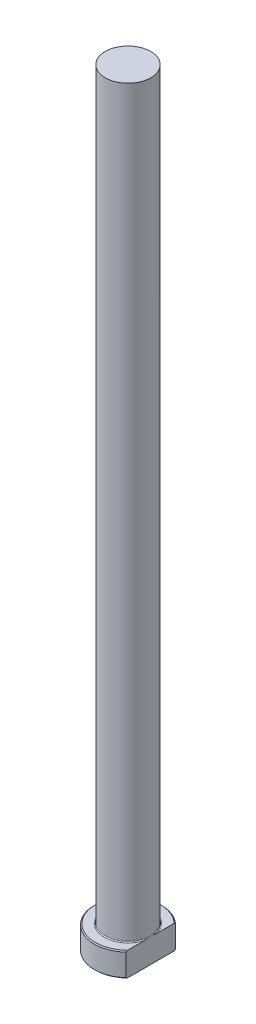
ISO-10303-21;
HEADER;
FILE_DESCRIPTION(('STEP AP214'),'2;1');
FILE_NAME('part.step','',(''),(''),'','','');
FILE_SCHEMA(('AUTOMOTIVE_DESIGN { 1 0 10303 214 1 1 1 1 }'));
ENDSEC;
DATA;
#1=APPLICATION_CONTEXT('core data for automotive mechanical design processes');
#2=APPLICATION_PROTOCOL_DEFINITION('international standard','automotive_design',2000,#1);
#3=PRODUCT_CONTEXT('',#1,'mechanical');
#4=PRODUCT('Part','Part','',(#3));
#5=PRODUCT_RELATED_PRODUCT_CATEGORY('part','',(#4));
#6=PRODUCT_DEFINITION_FORMATION('','',#4);
#7=PRODUCT_DEFINITION_CONTEXT('part definition',#1,'design');
#8=PRODUCT_DEFINITION('design','',#6,#7);
#9=PRODUCT_DEFINITION_SHAPE('','',#8);
#10=(LENGTH_UNIT() NAMED_UNIT(*) SI_UNIT(.MILLI.,.METRE.));
#11=(NAMED_UNIT(*) PLANE_ANGLE_UNIT() SI_UNIT($,.RADIAN.));
#12=(NAMED_UNIT(*) SI_UNIT($,.STERADIAN.) SOLID_ANGLE_UNIT());
#13=UNCERTAINTY_MEASURE_WITH_UNIT(LENGTH_MEASURE(1.E-05),#10,'distance_accuracy_value','');
#14=(GEOMETRIC_REPRESENTATION_CONTEXT(3) GLOBAL_UNCERTAINTY_ASSIGNED_CONTEXT((#13)) GLOBAL_UNIT_ASSIGNED_CONTEXT((#10,
#11,#12)) REPRESENTATION_CONTEXT('',''));
#15=CARTESIAN_POINT('',(0.,0.,0.));
#16=DIRECTION('',(0.,0.,1.));
#17=DIRECTION('',(1.,0.,0.));
#18=AXIS2_PLACEMENT_3D('',#15,#16,#17);
#19=CARTESIAN_POINT('',(0.,0.,0.));
#20=DIRECTION('',(0.,-1.,0.));
#21=DIRECTION('',(0.,0.,-1.));
#22=AXIS2_PLACEMENT_3D('',#19,#20,#21);
#23=PLANE('',#22);
#24=CARTESIAN_POINT('',(0.,0.,0.));
#25=DIRECTION('',(0.,-1.,0.));
#26=DIRECTION('',(0.,0.,-1.));
#27=AXIS2_PLACEMENT_3D('',#24,#25,#26);
#28=CIRCLE('',#27,6.79999999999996);
#29=CARTESIAN_POINT('',(4.74999999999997,0.,4.86595314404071));
#30=VERTEX_POINT('',#29);
#31=CARTESIAN_POINT('',(4.74999999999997,0.,-4.86595314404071));
#32=VERTEX_POINT('',#31);
#33=EDGE_CURVE('E98',#30,#32,#28,.T.);
#34=ORIENTED_EDGE('',*,*,#33,.T.);
#35=DIRECTION('',(0.,0.,1.));
#36=VECTOR('',#35,1.);
#37=CARTESIAN_POINT('',(4.74999999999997,0.,-5.14174095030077));
#38=LINE('',#37,#36);
#39=EDGE_CURVE('E83',#32,#30,#38,.T.);
#40=ORIENTED_EDGE('',*,*,#39,.T.);
#41=EDGE_LOOP('',(#34,#40));
#42=FACE_BOUND('',#41,.T.);
#43=ADVANCED_FACE('F32',(#42),#23,.T.);
#44=CARTESIAN_POINT('',(0.,259.958771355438,0.));
#45=DIRECTION('',(0.,1.,0.));
#46=DIRECTION('',(0.,0.,1.));
#47=AXIS2_PLACEMENT_3D('',#44,#45,#46);
#48=CYLINDRICAL_SURFACE('',#47,6.99999999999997);
#49=CARTESIAN_POINT('',(0.,4.80000000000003,0.));
#50=DIRECTION('',(0.,1.,0.));
#51=DIRECTION('',(0.,0.,1.));
#52=AXIS2_PLACEMENT_3D('',#49,#50,#51);
#53=CIRCLE('',#52,6.99999999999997);
#54=CARTESIAN_POINT('',(4.74999999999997,4.80000000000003,5.14174095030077));
#55=VERTEX_POINT('',#54);
#56=CARTESIAN_POINT('',(4.74999999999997,4.80000000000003,-5.14174095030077));
#57=VERTEX_POINT('',#56);
#58=EDGE_CURVE('E104',#55,#57,#53,.F.);
#59=ORIENTED_EDGE('',*,*,#58,.T.);
#60=DIRECTION('',(0.,-1.,0.));
#61=VECTOR('',#60,1.);
#62=CARTESIAN_POINT('',(4.74999999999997,160.,-5.14174095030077));
#63=LINE('',#62,#61);
#64=CARTESIAN_POINT('',(4.74999999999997,0.200000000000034,-5.14174095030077));
#65=VERTEX_POINT('',#64);
#66=EDGE_CURVE('E183',#57,#65,#63,.T.);
#67=ORIENTED_EDGE('',*,*,#66,.T.);
#68=CARTESIAN_POINT('',(0.,0.200000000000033,0.));
#69=DIRECTION('',(0.,-1.,0.));
#70=DIRECTION('',(0.,0.,-1.));
#71=AXIS2_PLACEMENT_3D('',#68,#69,#70);
#72=CIRCLE('',#71,6.99999999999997);
#73=CARTESIAN_POINT('',(4.74999999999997,0.200000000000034,5.14174095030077));
#74=VERTEX_POINT('',#73);
#75=EDGE_CURVE('E100',#65,#74,#72,.F.);
#76=ORIENTED_EDGE('',*,*,#75,.T.);
#77=DIRECTION('',(0.,-1.,0.));
#78=VECTOR('',#77,1.);
#79=CARTESIAN_POINT('',(4.74999999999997,160.,5.14174095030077));
#80=LINE('',#79,#78);
#81=EDGE_CURVE('E93',#55,#74,#80,.T.);
#82=ORIENTED_EDGE('',*,*,#81,.F.);
#83=EDGE_LOOP('',(#59,#67,#76,#82));
#84=FACE_BOUND('',#83,.T.);
#85=ADVANCED_FACE('F158',(#84),#48,.T.);
#86=CARTESIAN_POINT('',(-6.99999999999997,5.,0.));
#87=DIRECTION('',(0.,1.,0.));
#88=DIRECTION('',(0.,0.,1.));
#89=AXIS2_PLACEMENT_3D('',#86,#87,#88);
#90=PLANE('',#89);
#91=CARTESIAN_POINT('',(0.,5.,0.));
#92=DIRECTION('',(0.,1.,0.));
#93=DIRECTION('',(0.,0.,1.));
#94=AXIS2_PLACEMENT_3D('',#91,#92,#93);
#95=CIRCLE('',#94,6.80000000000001);
#96=CARTESIAN_POINT('',(4.74999999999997,5.,-4.86595314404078));
#97=VERTEX_POINT('',#96);
#98=CARTESIAN_POINT('',(4.74999999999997,5.,4.86595314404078));
#99=VERTEX_POINT('',#98);
#100=EDGE_CURVE('E178',#97,#99,#95,.T.);
#101=ORIENTED_EDGE('',*,*,#100,.T.);
#102=DIRECTION('',(0.,0.,-1.));
#103=VECTOR('',#102,1.);
#104=CARTESIAN_POINT('',(4.74999999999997,5.,0.));
#105=LINE('',#104,#103);
#106=CARTESIAN_POINT('',(4.74999999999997,4.99999999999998,1.3928388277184));
#107=VERTEX_POINT('',#106);
#108=EDGE_CURVE('E57',#99,#107,#105,.T.);
#109=ORIENTED_EDGE('',*,*,#108,.T.);
#110=CARTESIAN_POINT('',(0.,5.,0.));
#111=DIRECTION('',(0.,1.,0.));
#112=DIRECTION('',(0.,0.,1.));
#113=AXIS2_PLACEMENT_3D('',#110,#111,#112);
#114=CIRCLE('',#113,4.94999999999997);
#115=CARTESIAN_POINT('',(4.74999999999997,4.99999999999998,-1.3928388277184));
#116=VERTEX_POINT('',#115);
#117=EDGE_CURVE('E107',#107,#116,#114,.F.);
#118=ORIENTED_EDGE('',*,*,#117,.T.);
#119=EDGE_CURVE('E136',#116,#97,#105,.T.);
#120=ORIENTED_EDGE('',*,*,#119,.T.);
#121=EDGE_LOOP('',(#101,#109,#118,#120));
#122=FACE_BOUND('',#121,.T.);
#123=ADVANCED_FACE('F147',(#122),#90,.T.);
#124=CARTESIAN_POINT('',(0.,5.,0.));
#125=DIRECTION('',(0.,-1.,0.));
#126=DIRECTION('',(0.,0.,-1.));
#127=AXIS2_PLACEMENT_3D('',#124,#125,#126);
#128=CONICAL_SURFACE('',#127,6.8,0.785398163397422);
#129=ORIENTED_EDGE('',*,*,#58,.F.);
#130=CARTESIAN_POINT('',(4.74999999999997,-0.469919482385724,11.3131969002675));
#131=CARTESIAN_POINT('',(4.74999999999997,-0.314696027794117,11.1448436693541));
#132=CARTESIAN_POINT('',(4.74999999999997,-0.159749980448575,10.9762347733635));
#133=CARTESIAN_POINT('',(4.74999999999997,0.14950352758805,10.6384300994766));
#134=CARTESIAN_POINT('',(4.74999999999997,0.30381098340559,10.4692343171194));
#135=CARTESIAN_POINT('',(4.74999999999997,0.765713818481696,9.96058276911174));
#136=CARTESIAN_POINT('',(4.74999999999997,1.07222147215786,9.62013661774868));
#137=CARTESIAN_POINT('',(4.74999999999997,1.68320129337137,8.93374171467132));
#138=CARTESIAN_POINT('',(4.74999999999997,1.98765016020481,8.58777219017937));
#139=CARTESIAN_POINT('',(4.74999999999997,2.59113928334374,7.89119777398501));
#140=CARTESIAN_POINT('',(4.74999999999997,2.8901801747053,7.54059343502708));
#141=CARTESIAN_POINT('',(4.74999999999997,3.42455557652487,6.90003552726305));
#142=CARTESIAN_POINT('',(4.74999999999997,3.6612159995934,6.61119029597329));
#143=CARTESIAN_POINT('',(4.74999999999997,4.12759376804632,6.02778658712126));
#144=CARTESIAN_POINT('',(4.74999999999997,4.35730941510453,5.73322674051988));
#145=CARTESIAN_POINT('',(4.74999999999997,4.69416955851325,5.28581629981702));
#146=CARTESIAN_POINT('',(4.74999999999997,4.80511599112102,5.13582910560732));
#147=CARTESIAN_POINT('',(4.74999999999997,5.02390767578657,4.83361366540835));
#148=CARTESIAN_POINT('',(4.74999999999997,5.13175307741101,4.68138552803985));
#149=CARTESIAN_POINT('',(4.74999999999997,5.34359776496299,4.37435384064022));
#150=CARTESIAN_POINT('',(4.74999999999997,5.44759851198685,4.21955130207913));
#151=CARTESIAN_POINT('',(4.74999999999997,5.65085213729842,3.9068707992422));
#152=CARTESIAN_POINT('',(4.74999999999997,5.75010555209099,3.74899318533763));
#153=CARTESIAN_POINT('',(4.74999999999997,5.94167933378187,3.43122886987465));
#154=CARTESIAN_POINT('',(4.74999999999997,6.03405942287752,3.27137837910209));
#155=CARTESIAN_POINT('',(4.74999999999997,6.21141459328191,2.94756528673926));
#156=CARTESIAN_POINT('',(4.74999999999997,6.29638886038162,2.78360223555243));
#157=CARTESIAN_POINT('',(4.74999999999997,6.45680192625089,2.45121104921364));
#158=CARTESIAN_POINT('',(4.74999999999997,6.53224904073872,2.28278696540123));
#159=CARTESIAN_POINT('',(4.74999999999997,6.67109238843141,1.94101575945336));
#160=CARTESIAN_POINT('',(4.74999999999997,6.73449211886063,1.76767008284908));
#161=CARTESIAN_POINT('',(4.74999999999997,6.83411180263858,1.45416369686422));
#162=CARTESIAN_POINT('',(4.74999999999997,6.87324454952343,1.31493382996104));
#163=CARTESIAN_POINT('',(4.74999999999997,6.94070239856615,1.03386040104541));
#164=CARTESIAN_POINT('',(4.74999999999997,6.96902891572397,0.892017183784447));
#165=CARTESIAN_POINT('',(4.74999999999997,7.01345691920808,0.606842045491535));
#166=CARTESIAN_POINT('',(4.74999999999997,7.02959521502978,0.463515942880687));
#167=CARTESIAN_POINT('',(4.74999999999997,7.04890487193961,0.17598432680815));
#168=CARTESIAN_POINT('',(4.74999999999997,7.05207679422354,0.0317788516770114));
#169=CARTESIAN_POINT('',(4.74999999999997,7.04526462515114,-0.256545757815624));
#170=CARTESIAN_POINT('',(4.74999999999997,7.03525957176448,-0.400664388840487));
#171=CARTESIAN_POINT('',(4.74999999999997,7.00262759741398,-0.687454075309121));
#172=CARTESIAN_POINT('',(4.74999999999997,6.97999962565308,-0.830125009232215));
#173=CARTESIAN_POINT('',(4.74999999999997,6.92319898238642,-1.11357185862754));
#174=CARTESIAN_POINT('',(4.74999999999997,6.88899117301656,-1.25434063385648));
#175=CARTESIAN_POINT('',(4.74999999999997,6.8105357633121,-1.53301777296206));
#176=CARTESIAN_POINT('',(4.74999999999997,6.76628793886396,-1.67092607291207));
#177=CARTESIAN_POINT('',(4.74999999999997,6.6615135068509,-1.96556191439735));
#178=CARTESIAN_POINT('',(4.74999999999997,6.59951436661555,-2.12176199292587));
#179=CARTESIAN_POINT('',(4.74999999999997,6.46624368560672,-2.43018851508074));
#180=CARTESIAN_POINT('',(4.74999999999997,6.39496797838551,-2.58241313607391));
#181=CARTESIAN_POINT('',(4.74999999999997,6.24487152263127,-2.88340045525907));
#182=CARTESIAN_POINT('',(4.74999999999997,6.16603778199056,-3.0321566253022));
#183=CARTESIAN_POINT('',(4.74999999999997,6.00242135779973,-3.3263122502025));
#184=CARTESIAN_POINT('',(4.74999999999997,5.91763949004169,-3.4717121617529));
#185=CARTESIAN_POINT('',(4.74999999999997,5.74221965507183,-3.76133460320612));
#186=CARTESIAN_POINT('',(4.74999999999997,5.65152319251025,-3.90552153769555));
#187=CARTESIAN_POINT('',(4.74999999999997,5.46614513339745,-4.19130524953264));
#188=CARTESIAN_POINT('',(4.74999999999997,5.37146343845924,-4.33290196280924));
#189=CARTESIAN_POINT('',(4.74999999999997,5.1789439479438,-4.6137100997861));
#190=CARTESIAN_POINT('',(4.74999999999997,5.0811095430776,-4.75292385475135));
#191=CARTESIAN_POINT('',(4.74999999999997,4.88274984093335,-5.02942406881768));
#192=CARTESIAN_POINT('',(4.74999999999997,4.78222443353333,-5.16671044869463));
#193=CARTESIAN_POINT('',(4.74999999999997,4.47850577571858,-5.57446661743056));
#194=CARTESIAN_POINT('',(4.74999999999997,4.27202152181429,-5.84248508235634));
#195=CARTESIAN_POINT('',(4.74999999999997,3.85277361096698,-6.37356852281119));
#196=CARTESIAN_POINT('',(4.74999999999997,3.64000936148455,-6.63663302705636));
#197=CARTESIAN_POINT('',(4.74999999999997,3.20967704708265,-7.15912738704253));
#198=CARTESIAN_POINT('',(4.74999999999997,2.99210547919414,-7.41855435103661));
#199=CARTESIAN_POINT('',(4.74999999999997,2.55343543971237,-7.93440929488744));
#200=CARTESIAN_POINT('',(4.74999999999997,2.33233690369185,-8.190837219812));
#201=CARTESIAN_POINT('',(4.74999999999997,1.89851178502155,-8.68856037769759));
#202=CARTESIAN_POINT('',(4.74999999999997,1.68591840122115,-8.92997190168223));
#203=CARTESIAN_POINT('',(4.74999999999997,1.25875024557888,-9.41103988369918));
#204=CARTESIAN_POINT('',(4.74999999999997,1.04417544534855,-9.65069631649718));
#205=CARTESIAN_POINT('',(4.74999999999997,0.61376154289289,-10.128184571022));
#206=CARTESIAN_POINT('',(4.74999999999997,0.397924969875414,-10.3660186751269));
#207=CARTESIAN_POINT('',(4.74999999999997,-0.0350706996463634,-10.8404648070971));
#208=CARTESIAN_POINT('',(4.74999999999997,-0.252229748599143,-11.0770768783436));
#209=CARTESIAN_POINT('',(4.74999999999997,-0.469919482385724,-11.3131969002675));
#210=B_SPLINE_CURVE_WITH_KNOTS('',3,(#130,#131,#132,#133,#134,#135,#136,#137,#138,#139,#140,
#141,#142,#143,#144,#145,#146,#147,#148,#149,#150,#151,#152,#153,#154,#155,#156,#157,#158,#159,
#160,#161,#162,#163,#164,#165,#166,#167,#168,#169,#170,#171,#172,#173,#174,#175,#176,#177,#178,
#179,#180,#181,#182,#183,#184,#185,#186,#187,#188,#189,#190,#191,#192,#193,#194,#195,#196,#197,
#198,#199,#200,#201,#202,#203,#204,#205,#206,#207,#208,#209),.UNSPECIFIED.,.F.,.F.,(4,2,2,2,2,2,
2,2,2,2,2,2,2,2,2,2,2,2,2,2,2,2,2,2,2,2,2,2,2,2,2,2,2,2,2,2,2,2,2,4),(0.,0.686973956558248,
1.37395314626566,2.74821299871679,4.13073127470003,5.51308613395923,6.63326732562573,
7.7537202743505,8.31337506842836,8.87300282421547,9.43241566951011,9.99176514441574,
10.5454852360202,11.0992661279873,11.6525602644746,12.2056935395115,12.6392019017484,
13.0726534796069,13.5047907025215,13.9369092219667,14.3697159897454,14.8025587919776,
15.2367269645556,15.6709048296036,16.1746896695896,16.6787015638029,17.1835959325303,
17.6884211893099,18.1993613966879,18.7103142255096,19.2207347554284,19.7311762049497,
20.7460271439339,21.7609741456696,22.7766868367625,23.7924181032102,24.7574331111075,
25.7224619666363,26.6859680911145,27.6494397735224),.UNSPECIFIED.);
#211=EDGE_CURVE('E135',#55,#99,#210,.T.);
#212=ORIENTED_EDGE('',*,*,#211,.T.);
#213=ORIENTED_EDGE('',*,*,#100,.F.);
#214=EDGE_CURVE('E127',#97,#57,#210,.T.);
#215=ORIENTED_EDGE('',*,*,#214,.T.);
#216=EDGE_LOOP('',(#129,#212,#213,#215));
#217=FACE_BOUND('',#216,.T.);
#218=ADVANCED_FACE('F143',(#217),#128,.T.);
#219=CARTESIAN_POINT('',(0.,0.200000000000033,0.));
#220=DIRECTION('',(0.,1.,0.));
#221=DIRECTION('',(0.,0.,1.));
#222=AXIS2_PLACEMENT_3D('',#219,#220,#221);
#223=CONICAL_SURFACE('',#222,6.99999999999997,0.785398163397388);
#224=ORIENTED_EDGE('',*,*,#75,.F.);
#225=CARTESIAN_POINT('',(4.74999999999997,5.46991948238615,-11.3131969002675));
#226=CARTESIAN_POINT('',(4.74999999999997,5.31469602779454,-11.1448436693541));
#227=CARTESIAN_POINT('',(4.74999999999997,5.15974998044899,-10.9762347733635));
#228=CARTESIAN_POINT('',(4.74999999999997,4.85049647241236,-10.6384300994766));
#229=CARTESIAN_POINT('',(4.74999999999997,4.69618901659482,-10.4692343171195));
#230=CARTESIAN_POINT('',(4.74999999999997,4.2342861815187,-9.9605827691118));
#231=CARTESIAN_POINT('',(4.74999999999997,3.92777852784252,-9.62013661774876));
#232=CARTESIAN_POINT('',(4.74999999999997,3.316798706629,-8.93374171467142));
#233=CARTESIAN_POINT('',(4.74999999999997,3.01234983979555,-8.58777219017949));
#234=CARTESIAN_POINT('',(4.74999999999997,2.4088607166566,-7.89119777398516));
#235=CARTESIAN_POINT('',(4.74999999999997,2.10981982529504,-7.54059343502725));
#236=CARTESIAN_POINT('',(4.74999999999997,1.57544442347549,-6.90003552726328));
#237=CARTESIAN_POINT('',(4.74999999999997,1.33878400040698,-6.61119029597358));
#238=CARTESIAN_POINT('',(4.74999999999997,0.8724062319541,-6.02778658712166));
#239=CARTESIAN_POINT('',(4.74999999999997,0.642690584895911,-5.73322674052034));
#240=CARTESIAN_POINT('',(4.74999999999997,0.305830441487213,-5.28581629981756));
#241=CARTESIAN_POINT('',(4.74999999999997,0.19488400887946,-5.13582910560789));
#242=CARTESIAN_POINT('',(4.74999999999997,-0.0239076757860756,-4.83361366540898));
#243=CARTESIAN_POINT('',(4.74999999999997,-0.13175307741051,-4.68138552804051));
#244=CARTESIAN_POINT('',(4.74999999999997,-0.343597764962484,-4.37435384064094));
#245=CARTESIAN_POINT('',(4.74999999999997,-0.447598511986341,-4.21955130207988));
#246=CARTESIAN_POINT('',(4.74999999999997,-0.650852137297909,-3.90687079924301));
#247=CARTESIAN_POINT('',(4.74999999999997,-0.750105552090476,-3.74899318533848));
#248=CARTESIAN_POINT('',(4.74999999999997,-0.941679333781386,-3.43122886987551));
#249=CARTESIAN_POINT('',(4.74999999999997,-1.03405942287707,-3.27137837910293));
#250=CARTESIAN_POINT('',(4.74999999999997,-1.21141459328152,-2.94756528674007));
#251=CARTESIAN_POINT('',(4.74999999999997,-1.29638886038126,-2.78360223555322));
#252=CARTESIAN_POINT('',(4.74999999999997,-1.4568019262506,-2.4512110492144));
#253=CARTESIAN_POINT('',(4.74999999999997,-1.53224904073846,-2.28278696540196));
#254=CARTESIAN_POINT('',(4.74999999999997,-1.67109238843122,-1.94101575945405));
#255=CARTESIAN_POINT('',(4.74999999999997,-1.73449211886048,-1.76767008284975));
#256=CARTESIAN_POINT('',(4.74999999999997,-1.83411180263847,-1.45416369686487));
#257=CARTESIAN_POINT('',(4.74999999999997,-1.87324454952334,-1.3149338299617));
#258=CARTESIAN_POINT('',(4.74999999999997,-1.94070239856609,-1.03386040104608));
#259=CARTESIAN_POINT('',(4.74999999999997,-1.96902891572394,-0.892017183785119));
#260=CARTESIAN_POINT('',(4.74999999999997,-2.01345691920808,-0.606842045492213));
#261=CARTESIAN_POINT('',(4.74999999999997,-2.02959521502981,-0.463515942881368));
#262=CARTESIAN_POINT('',(4.74999999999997,-2.04890487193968,-0.175984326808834));
#263=CARTESIAN_POINT('',(4.74999999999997,-2.05207679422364,-0.0317788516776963));
#264=CARTESIAN_POINT('',(4.74999999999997,-2.04526462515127,0.25654575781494));
#265=CARTESIAN_POINT('',(4.74999999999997,-2.03525957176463,0.400664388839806));
#266=CARTESIAN_POINT('',(4.74999999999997,-2.00262759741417,0.687454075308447));
#267=CARTESIAN_POINT('',(4.74999999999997,-1.97999962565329,0.830125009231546));
#268=CARTESIAN_POINT('',(4.74999999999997,-1.92319898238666,1.11357185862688));
#269=CARTESIAN_POINT('',(4.74999999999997,-1.88899117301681,1.25434063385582));
#270=CARTESIAN_POINT('',(4.74999999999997,-1.81053576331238,1.53301777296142));
#271=CARTESIAN_POINT('',(4.74999999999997,-1.76628793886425,1.67092607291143));
#272=CARTESIAN_POINT('',(4.74999999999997,-1.66151350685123,1.96556191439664));
#273=CARTESIAN_POINT('',(4.74999999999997,-1.59951436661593,2.1217619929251));
#274=CARTESIAN_POINT('',(4.74999999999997,-1.46624368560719,2.43018851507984));
#275=CARTESIAN_POINT('',(4.74999999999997,-1.39496797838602,2.58241313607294));
#276=CARTESIAN_POINT('',(4.74999999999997,-1.24487152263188,2.88340045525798));
#277=CARTESIAN_POINT('',(4.74999999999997,-1.16603778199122,3.03215662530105));
#278=CARTESIAN_POINT('',(4.74999999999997,-1.00242135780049,3.32631225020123));
#279=CARTESIAN_POINT('',(4.74999999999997,-0.917639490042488,3.47171216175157));
#280=CARTESIAN_POINT('',(4.74999999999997,-0.742219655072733,3.76133460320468));
#281=CARTESIAN_POINT('',(4.74999999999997,-0.65152319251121,3.90552153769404));
#282=CARTESIAN_POINT('',(4.74999999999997,-0.466145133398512,4.19130524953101));
#283=CARTESIAN_POINT('',(4.74999999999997,-0.371463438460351,4.33290196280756));
#284=CARTESIAN_POINT('',(4.74999999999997,-0.178943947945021,4.6137100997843));
#285=CARTESIAN_POINT('',(4.74999999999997,-0.081109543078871,4.75292385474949));
#286=CARTESIAN_POINT('',(4.74999999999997,0.117250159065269,5.02942406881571));
#287=CARTESIAN_POINT('',(4.74999999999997,0.217775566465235,5.1667104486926));
#288=CARTESIAN_POINT('',(4.74999999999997,0.521494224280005,5.57446661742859));
#289=CARTESIAN_POINT('',(4.74999999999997,0.727978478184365,5.84248508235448));
#290=CARTESIAN_POINT('',(4.74999999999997,1.14722638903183,6.37356852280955));
#291=CARTESIAN_POINT('',(4.74999999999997,1.35999063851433,6.63663302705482));
#292=CARTESIAN_POINT('',(4.74999999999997,1.7903229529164,7.15912738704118));
#293=CARTESIAN_POINT('',(4.74999999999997,2.00789452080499,7.41855435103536));
#294=CARTESIAN_POINT('',(4.74999999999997,2.44656456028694,7.93440929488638));
#295=CARTESIAN_POINT('',(4.74999999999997,2.66766309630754,8.19083721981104));
#296=CARTESIAN_POINT('',(4.74999999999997,3.10148821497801,8.6885603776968));
#297=CARTESIAN_POINT('',(4.74999999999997,3.31408159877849,8.92997190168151));
#298=CARTESIAN_POINT('',(4.74999999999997,3.74124975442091,9.4110398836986));
#299=CARTESIAN_POINT('',(4.74999999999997,3.95582455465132,9.65069631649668));
#300=CARTESIAN_POINT('',(4.74999999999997,4.38623845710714,10.1281845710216));
#301=CARTESIAN_POINT('',(4.74999999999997,4.6020750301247,10.3660186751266));
#302=CARTESIAN_POINT('',(4.74999999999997,5.03507069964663,10.840464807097));
#303=CARTESIAN_POINT('',(4.74999999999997,5.25222974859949,11.0770768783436));
#304=CARTESIAN_POINT('',(4.74999999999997,5.46991948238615,11.3131969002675));
#305=B_SPLINE_CURVE_WITH_KNOTS('',3,(#225,#226,#227,#228,#229,#230,#231,#232,#233,#234,#235,
#236,#237,#238,#239,#240,#241,#242,#243,#244,#245,#246,#247,#248,#249,#250,#251,#252,#253,#254,
#255,#256,#257,#258,#259,#260,#261,#262,#263,#264,#265,#266,#267,#268,#269,#270,#271,#272,#273,
#274,#275,#276,#277,#278,#279,#280,#281,#282,#283,#284,#285,#286,#287,#288,#289,#290,#291,#292,
#293,#294,#295,#296,#297,#298,#299,#300,#301,#302,#303,#304),.UNSPECIFIED.,.F.,.F.,(4,2,2,2,2,2,
2,2,2,2,2,2,2,2,2,2,2,2,2,2,2,2,2,2,2,2,2,2,2,2,2,2,2,2,2,2,2,2,2,4),(0.,0.686973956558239,
1.37395314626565,2.74821299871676,4.13073127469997,5.51308613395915,6.63326732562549,
7.7537202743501,8.31337506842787,8.87300282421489,9.43241566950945,9.991765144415,
10.5454852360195,11.0992661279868,11.6525602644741,12.2056935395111,12.6392019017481,
13.0726534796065,13.5047907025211,13.9369092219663,14.369715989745,14.8025587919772,
15.2367269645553,15.6709048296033,16.174689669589,16.6787015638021,17.1835959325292,
17.6884211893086,18.1993613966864,18.7103142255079,19.2207347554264,19.7311762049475,
20.7460271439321,21.7609741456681,22.7766868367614,23.7924181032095,24.7574331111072,
25.7224619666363,26.6859680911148,27.649439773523),.UNSPECIFIED.);
#306=EDGE_CURVE('E86',#65,#32,#305,.T.);
#307=ORIENTED_EDGE('',*,*,#306,.T.);
#308=ORIENTED_EDGE('',*,*,#33,.F.);
#309=EDGE_CURVE('E89',#30,#74,#305,.T.);
#310=ORIENTED_EDGE('',*,*,#309,.T.);
#311=EDGE_LOOP('',(#224,#307,#308,#310));
#312=FACE_BOUND('',#311,.T.);
#313=ADVANCED_FACE('F97',(#312),#223,.T.);
#314=CARTESIAN_POINT('',(0.,5.19999999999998,0.));
#315=DIRECTION('',(0.,1.,0.));
#316=DIRECTION('',(0.,0.,1.));
#317=AXIS2_PLACEMENT_3D('',#314,#315,#316);
#318=TOROIDAL_SURFACE('',#317,4.94999999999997,0.2);
#319=CARTESIAN_POINT('',(4.74999999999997,5.19999999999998,0.));
#320=CARTESIAN_POINT('',(4.74999999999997,5.20000051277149,9.99652561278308E-11));
#321=CARTESIAN_POINT('',(4.74999999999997,5.20000102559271,-2.61635066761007E-07));
#322=CARTESIAN_POINT('',(4.74999999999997,5.20000197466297,-9.45069474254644E-07));
#323=CARTESIAN_POINT('',(4.74999999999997,5.20000238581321,-1.38557317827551E-06));
#324=CARTESIAN_POINT('',(4.74999999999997,5.20000327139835,-2.4536130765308E-06));
#325=CARTESIAN_POINT('',(4.74999999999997,5.20000372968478,-3.09837225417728E-06));
#326=CARTESIAN_POINT('',(4.74999999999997,5.20000452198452,-4.40742113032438E-06));
#327=CARTESIAN_POINT('',(4.74999999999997,5.20000486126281,-5.0689040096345E-06));
#328=CARTESIAN_POINT('',(4.74999999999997,5.20000618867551,-7.7310439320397E-06));
#329=CARTESIAN_POINT('',(4.74999999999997,5.20000711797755,-9.76516679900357E-06));
#330=CARTESIAN_POINT('',(4.74999999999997,5.20000857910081,-1.37140842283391E-05));
#331=CARTESIAN_POINT('',(4.74999999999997,5.20000914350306,-1.56172163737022E-05));
#332=CARTESIAN_POINT('',(4.74999999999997,5.20001162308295,-2.39378885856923E-05));
#333=CARTESIAN_POINT('',(4.74999999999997,5.20001356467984,-3.03487881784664E-05));
#334=CARTESIAN_POINT('',(4.74999999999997,5.2000163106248,-4.22704269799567E-05));
#335=CARTESIAN_POINT('',(4.74999999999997,5.20001725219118,-4.77489234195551E-05));
#336=CARTESIAN_POINT('',(4.74999999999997,5.20002427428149,-8.92044157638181E-05));
#337=CARTESIAN_POINT('',(4.74999999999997,5.20002979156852,-0.000125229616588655));
#338=CARTESIAN_POINT('',(4.74999999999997,5.20005392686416,-0.000268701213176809));
#339=CARTESIAN_POINT('',(4.74999999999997,5.2000767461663,-0.000375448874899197));
#340=CARTESIAN_POINT('',(4.74999999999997,5.20016644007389,-0.000801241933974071));
#341=CARTESIAN_POINT('',(4.74999999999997,5.20023075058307,-0.00112063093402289));
#342=CARTESIAN_POINT('',(4.74999999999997,5.20048998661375,-0.00239962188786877));
#343=CARTESIAN_POINT('',(4.74999999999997,5.20068823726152,-0.00335875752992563));
#344=CARTESIAN_POINT('',(4.74999999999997,5.20151726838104,-0.00737911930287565));
#345=CARTESIAN_POINT('',(4.74999999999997,5.20214386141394,-0.0104409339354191));
#346=CARTESIAN_POINT('',(4.74999999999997,5.21008545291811,-0.0492358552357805));
#347=CARTESIAN_POINT('',(4.74999999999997,5.21742440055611,-0.0849658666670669));
#348=CARTESIAN_POINT('',(4.74999999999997,5.23282863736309,-0.160441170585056));
#349=CARTESIAN_POINT('',(4.74999999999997,5.24088334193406,-0.20018852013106));
#350=CARTESIAN_POINT('',(4.74999999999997,5.25445255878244,-0.267938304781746));
#351=CARTESIAN_POINT('',(4.74999999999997,5.26001263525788,-0.29593149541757));
#352=CARTESIAN_POINT('',(4.74999999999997,5.27085683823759,-0.351182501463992));
#353=CARTESIAN_POINT('',(4.74999999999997,5.27614435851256,-0.378439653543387));
#354=CARTESIAN_POINT('',(4.74999999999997,5.29324107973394,-0.467894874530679));
#355=CARTESIAN_POINT('',(4.74999999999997,5.30473398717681,-0.530154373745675));
#356=CARTESIAN_POINT('',(4.74999999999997,5.32662739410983,-0.655478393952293));
#357=CARTESIAN_POINT('',(4.74999999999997,5.3370164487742,-0.718544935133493));
#358=CARTESIAN_POINT('',(4.74999999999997,5.35699717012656,-0.851017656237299));
#359=CARTESIAN_POINT('',(4.74999999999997,5.36641623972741,-0.920450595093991));
#360=CARTESIAN_POINT('',(4.74999999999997,5.38234392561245,-1.05946734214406));
#361=CARTESIAN_POINT('',(4.74999999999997,5.38886038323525,-1.12905022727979));
#362=CARTESIAN_POINT('',(4.74999999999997,5.39773147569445,-1.26617933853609));
#363=CARTESIAN_POINT('',(4.74999999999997,5.40021821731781,-1.33371570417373));
#364=CARTESIAN_POINT('',(4.74999999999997,5.39987187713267,-1.43440379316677));
#365=CARTESIAN_POINT('',(4.74999999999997,5.39910217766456,-1.46756163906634));
#366=CARTESIAN_POINT('',(4.74999999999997,5.3959313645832,-1.53379187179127));
#367=CARTESIAN_POINT('',(4.74999999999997,5.3935310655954,-1.56686429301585));
#368=CARTESIAN_POINT('',(4.74999999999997,5.38754200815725,-1.62421123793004));
#369=CARTESIAN_POINT('',(4.74999999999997,5.38442539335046,-1.64853446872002));
#370=CARTESIAN_POINT('',(4.74999999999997,5.37675802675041,-1.69705811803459));
#371=CARTESIAN_POINT('',(4.74999999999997,5.37220190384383,-1.721257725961));
#372=CARTESIAN_POINT('',(4.74999999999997,5.36082299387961,-1.77105703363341));
#373=CARTESIAN_POINT('',(4.74999999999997,5.353854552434,-1.79662379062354));
#374=CARTESIAN_POINT('',(4.74999999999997,5.33689507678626,-1.84682085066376));
#375=CARTESIAN_POINT('',(4.74999999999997,5.32690690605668,-1.87145201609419));
#376=CARTESIAN_POINT('',(4.74999999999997,5.30823837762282,-1.90659698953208));
#377=CARTESIAN_POINT('',(4.74999999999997,5.30136403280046,-1.91805641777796));
#378=CARTESIAN_POINT('',(4.74999999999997,5.28594833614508,-1.93977517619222));
#379=CARTESIAN_POINT('',(4.74999999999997,5.27741816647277,-1.95004185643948));
#380=CARTESIAN_POINT('',(4.74999999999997,5.26375777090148,-1.9629385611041));
#381=CARTESIAN_POINT('',(4.74999999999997,5.25954376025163,-1.96653183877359));
#382=CARTESIAN_POINT('',(4.74999999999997,5.25068624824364,-1.97316149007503));
#383=CARTESIAN_POINT('',(4.74999999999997,5.24604250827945,-1.97619755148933));
#384=CARTESIAN_POINT('',(4.74999999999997,5.23626853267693,-1.98154515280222));
#385=CARTESIAN_POINT('',(4.74999999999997,5.23113290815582,-1.98384708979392));
#386=CARTESIAN_POINT('',(4.74999999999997,5.22051769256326,-1.98742814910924));
#387=CARTESIAN_POINT('',(4.74999999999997,5.21503893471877,-1.98870965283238));
#388=CARTESIAN_POINT('',(4.74999999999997,5.20449183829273,-1.99000622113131));
#389=CARTESIAN_POINT('',(4.74999999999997,5.19943775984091,-1.99013586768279));
#390=CARTESIAN_POINT('',(4.74999999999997,5.18940003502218,-1.98941072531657));
#391=CARTESIAN_POINT('',(4.74999999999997,5.18441641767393,-1.98855554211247));
#392=CARTESIAN_POINT('',(4.74999999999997,5.17528807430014,-1.98612622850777));
#393=CARTESIAN_POINT('',(4.74999999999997,5.17111543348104,-1.98465315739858));
#394=CARTESIAN_POINT('',(4.74999999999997,5.16301803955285,-1.98114415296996));
#395=CARTESIAN_POINT('',(4.74999999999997,5.15909332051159,-1.9791081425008));
#396=CARTESIAN_POINT('',(4.74999999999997,5.14879352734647,-1.97296283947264));
#397=CARTESIAN_POINT('',(4.74999999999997,5.14268143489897,-1.96841428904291));
#398=CARTESIAN_POINT('',(4.74999999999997,5.1312135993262,-1.95844367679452));
#399=CARTESIAN_POINT('',(4.74999999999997,5.12586068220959,-1.95301850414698));
#400=CARTESIAN_POINT('',(4.74999999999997,5.11142906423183,-1.93662763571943));
#401=CARTESIAN_POINT('',(4.74999999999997,5.10316616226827,-1.92495191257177));
#402=CARTESIAN_POINT('',(4.74999999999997,5.08829914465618,-1.90062693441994));
#403=CARTESIAN_POINT('',(4.74999999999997,5.08169771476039,-1.88797614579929));
#404=CARTESIAN_POINT('',(4.74999999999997,5.06700138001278,-1.85623567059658));
#405=CARTESIAN_POINT('',(4.74999999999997,5.05959097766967,-1.83683236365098));
#406=CARTESIAN_POINT('',(4.74999999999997,5.04658538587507,-1.79741332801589));
#407=CARTESIAN_POINT('',(4.74999999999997,5.0409941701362,-1.77739636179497));
#408=CARTESIAN_POINT('',(4.74999999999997,5.0311351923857,-1.7367589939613));
#409=CARTESIAN_POINT('',(4.74999999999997,5.02688624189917,-1.71613409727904));
#410=CARTESIAN_POINT('',(4.74999999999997,5.01952414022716,-1.67471526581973));
#411=CARTESIAN_POINT('',(4.74999999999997,5.01640958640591,-1.65392157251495));
#412=CARTESIAN_POINT('',(4.74999999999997,5.00922057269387,-1.5974489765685));
#413=CARTESIAN_POINT('',(4.74999999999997,5.00602857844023,-1.56165812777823));
#414=CARTESIAN_POINT('',(4.74999999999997,5.00166820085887,-1.4899475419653));
#415=CARTESIAN_POINT('',(4.74999999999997,5.00050104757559,-1.45402773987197));
#416=CARTESIAN_POINT('',(4.74999999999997,4.99938051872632,-1.34597605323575));
#417=CARTESIAN_POINT('',(4.74999999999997,5.00183473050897,-1.27382091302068));
#418=CARTESIAN_POINT('',(4.74999999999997,5.01071422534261,-1.1348000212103));
#419=CARTESIAN_POINT('',(4.74999999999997,5.01685409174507,-1.06791253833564));
#420=CARTESIAN_POINT('',(4.74999999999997,5.03184377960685,-0.934412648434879));
#421=CARTESIAN_POINT('',(4.74999999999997,5.04069496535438,-0.86780039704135));
#422=CARTESIAN_POINT('',(4.74999999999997,5.05873681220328,-0.745814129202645));
#423=CARTESIAN_POINT('',(4.74999999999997,5.06763179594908,-0.690395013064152));
#424=CARTESIAN_POINT('',(4.74999999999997,5.08669539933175,-0.578250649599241));
#425=CARTESIAN_POINT('',(4.74999999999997,5.09689173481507,-0.521530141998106));
#426=CARTESIAN_POINT('',(4.74999999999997,5.11492144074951,-0.424926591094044));
#427=CARTESIAN_POINT('',(4.74999999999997,5.12256561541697,-0.385007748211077));
#428=CARTESIAN_POINT('',(4.74999999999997,5.13803971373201,-0.305676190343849));
#429=CARTESIAN_POINT('',(4.74999999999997,5.14586654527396,-0.266262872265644));
#430=CARTESIAN_POINT('',(4.74999999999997,5.16076951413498,-0.19204454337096));
#431=CARTESIAN_POINT('',(4.74999999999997,5.16782730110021,-0.157235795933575));
#432=CARTESIAN_POINT('',(4.74999999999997,5.18233886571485,-0.0861195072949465));
#433=CARTESIAN_POINT('',(4.74999999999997,5.18979650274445,-0.0498127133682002));
#434=CARTESIAN_POINT('',(4.74999999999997,5.19785759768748,-0.0104337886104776));
#435=CARTESIAN_POINT('',(4.74999999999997,5.19848564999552,-0.00736482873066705));
#436=CARTESIAN_POINT('',(4.74999999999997,5.19931501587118,-0.0033428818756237));
#437=CARTESIAN_POINT('',(4.74999999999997,5.19951211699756,-0.00238930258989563));
#438=CARTESIAN_POINT('',(4.74999999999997,5.19976995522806,-0.00111720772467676));
#439=CARTESIAN_POINT('',(4.74999999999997,5.19983399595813,-0.000799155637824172));
#440=CARTESIAN_POINT('',(4.74999999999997,5.19992336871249,-0.000374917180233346));
#441=CARTESIAN_POINT('',(4.74999999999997,5.19994614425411,-0.000268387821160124));
#442=CARTESIAN_POINT('',(4.74999999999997,5.19997023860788,-0.000125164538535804));
#443=CARTESIAN_POINT('',(4.74999999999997,5.19997575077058,-8.91681278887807E-05));
#444=CARTESIAN_POINT('',(4.74999999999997,5.19998276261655,-4.77422682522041E-05));
#445=CARTESIAN_POINT('',(4.74999999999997,5.19998370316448,-4.22652010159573E-05));
#446=CARTESIAN_POINT('',(4.74999999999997,5.19998644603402,-3.03466439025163E-05));
#447=CARTESIAN_POINT('',(4.74999999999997,5.19998838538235,-2.39373246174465E-05));
#448=CARTESIAN_POINT('',(4.74999999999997,5.19999086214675,-1.56183298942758E-05));
#449=CARTESIAN_POINT('',(4.74999999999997,5.19999142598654,-1.37153022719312E-05));
#450=CARTESIAN_POINT('',(4.74999999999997,5.19999288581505,-9.76651674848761E-06));
#451=CARTESIAN_POINT('',(4.74999999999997,5.19999381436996,-7.73240591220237E-06));
#452=CARTESIAN_POINT('',(4.74999999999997,5.1999951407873,-5.07019324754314E-06));
#453=CARTESIAN_POINT('',(4.74999999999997,5.19999547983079,-4.4086588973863E-06));
#454=CARTESIAN_POINT('',(4.74999999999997,5.19999627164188,-3.09946476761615E-06));
#455=CARTESIAN_POINT('',(4.74999999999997,5.19999672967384,-2.45460930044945E-06));
#456=CARTESIAN_POINT('',(4.74999999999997,5.19999761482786,-1.38635108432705E-06));
#457=CARTESIAN_POINT('',(4.74999999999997,5.19999802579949,-9.45734938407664E-07));
#458=CARTESIAN_POINT('',(4.74999999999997,5.19999897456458,-2.62005351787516E-07));
#459=CARTESIAN_POINT('',(4.74999999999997,5.19999948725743,-9.9959612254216E-11));
#460=CARTESIAN_POINT('',(4.74999999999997,5.19999999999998,0.));
#461=B_SPLINE_CURVE_WITH_KNOTS('',3,(#319,#320,#321,#322,#323,#324,#325,#326,#327,#328,#329,
#330,#331,#332,#333,#334,#335,#336,#337,#338,#339,#340,#341,#342,#343,#344,#345,#346,#347,#348,
#349,#350,#351,#352,#353,#354,#355,#356,#357,#358,#359,#360,#361,#362,#363,#364,#365,#366,#367,
#368,#369,#370,#371,#372,#373,#374,#375,#376,#377,#378,#379,#380,#381,#382,#383,#384,#385,#386,
#387,#388,#389,#390,#391,#392,#393,#394,#395,#396,#397,#398,#399,#400,#401,#402,#403,#404,#405,
#406,#407,#408,#409,#410,#411,#412,#413,#414,#415,#416,#417,#418,#419,#420,#421,#422,#423,#424,
#425,#426,#427,#428,#429,#430,#431,#432,#433,#434,#435,#436,#437,#438,#439,#440,#441,#442,#443,
#444,#445,#446,#447,#448,#449,#450,#451,#452,#453,#454,#455,#456,#457,#458,#459,#460),
.UNSPECIFIED.,.T.,.F.,(4,2,2,2,2,2,2,2,2,2,2,2,2,2,2,2,2,2,2,2,2,2,2,2,2,2,2,2,2,2,2,2,2,2,2,2,
2,2,2,2,2,2,2,2,2,2,2,2,2,2,2,2,2,2,2,2,2,2,2,2,2,2,2,2,2,2,2,2,2,2,4),(0.,1.57517755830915E-06,
3.40054002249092E-06,5.75445750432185E-06,7.98467699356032E-06,1.46735444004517E-05,
2.06230682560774E-05,4.06941666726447E-05,5.73532562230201E-05,0.000166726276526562,
0.000493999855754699,0.0014716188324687,0.00440957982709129,0.0137857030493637,
0.123211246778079,0.244877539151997,0.33049723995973,0.413792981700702,0.603718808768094,
0.795453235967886,1.00561491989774,1.21520536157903,1.41777458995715,1.51724627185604,
1.61666829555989,1.69020453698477,1.76401846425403,1.84342838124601,1.92276323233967,
1.96277163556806,2.00251870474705,2.01909887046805,2.03568829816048,2.05248658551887,
2.06924555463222,2.08431612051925,2.09939272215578,2.11261992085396,2.12584893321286,
2.14857242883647,2.1713784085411,2.21404845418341,2.25678703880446,2.31894678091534,
2.38124140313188,2.44437387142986,2.50742801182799,2.61514029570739,2.72291798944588,
2.93928110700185,3.1407288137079,3.34227805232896,3.51065271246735,3.6835337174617,
3.80546530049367,3.92601326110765,4.03256487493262,4.14375690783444,4.15315491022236,
4.15607585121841,4.15704937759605,4.15737598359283,4.15748526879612,4.15750192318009,
4.15752198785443,4.15752793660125,4.15753462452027,4.1575368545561,4.1575392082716,
4.15754103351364,4.15754260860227),.UNSPECIFIED.);
#462=CARTESIAN_POINT('',(4.74999999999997,5.19999999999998,0.));
#463=VERTEX_POINT('',#462);
#464=EDGE_CURVE('E11',#116,#463,#461,.T.);
#465=ORIENTED_EDGE('',*,*,#464,.F.);
#466=ORIENTED_EDGE('',*,*,#117,.F.);
#467=CARTESIAN_POINT('',(4.74999999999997,5.19999999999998,0.));
#468=CARTESIAN_POINT('',(4.74999999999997,5.19999948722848,-9.99651628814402E-11));
#469=CARTESIAN_POINT('',(4.74999999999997,5.19999897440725,2.6163506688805E-07));
#470=CARTESIAN_POINT('',(4.74999999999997,5.19999802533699,9.45069474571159E-07));
#471=CARTESIAN_POINT('',(4.74999999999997,5.19999761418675,1.38557317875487E-06));
#472=CARTESIAN_POINT('',(4.74999999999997,5.19999672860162,2.45361307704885E-06));
#473=CARTESIAN_POINT('',(4.74999999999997,5.19999627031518,3.09837225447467E-06));
#474=CARTESIAN_POINT('',(4.74999999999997,5.19999547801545,4.4074211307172E-06));
#475=CARTESIAN_POINT('',(4.74999999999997,5.19999513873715,5.06890401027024E-06));
#476=CARTESIAN_POINT('',(4.74999999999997,5.19999381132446,7.73104393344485E-06));
#477=CARTESIAN_POINT('',(4.74999999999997,5.19999288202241,9.76516679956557E-06));
#478=CARTESIAN_POINT('',(4.74999999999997,5.19999142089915,1.37140842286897E-05));
#479=CARTESIAN_POINT('',(4.74999999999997,5.1999908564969,1.56172163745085E-05));
#480=CARTESIAN_POINT('',(4.74999999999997,5.19998837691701,2.39378885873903E-05));
#481=CARTESIAN_POINT('',(4.74999999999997,5.19998643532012,3.03487881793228E-05));
#482=CARTESIAN_POINT('',(4.74999999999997,5.19998368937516,4.22704269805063E-05));
#483=CARTESIAN_POINT('',(4.74999999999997,5.19998274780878,4.77489234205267E-05));
#484=CARTESIAN_POINT('',(4.74999999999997,5.19997572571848,8.9204415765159E-05));
#485=CARTESIAN_POINT('',(4.74999999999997,5.19997020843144,0.000125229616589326));
#486=CARTESIAN_POINT('',(4.74999999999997,5.19994607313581,0.000268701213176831));
#487=CARTESIAN_POINT('',(4.74999999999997,5.19992325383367,0.000375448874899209));
#488=CARTESIAN_POINT('',(4.74999999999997,5.19983355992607,0.000801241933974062));
#489=CARTESIAN_POINT('',(4.74999999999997,5.1997692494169,0.0011206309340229));
#490=CARTESIAN_POINT('',(4.74999999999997,5.19951001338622,0.00239962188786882));
#491=CARTESIAN_POINT('',(4.74999999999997,5.19931176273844,0.00335875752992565));
#492=CARTESIAN_POINT('',(4.74999999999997,5.19848273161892,0.00737911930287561));
#493=CARTESIAN_POINT('',(4.74999999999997,5.19785613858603,0.0104409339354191));
#494=CARTESIAN_POINT('',(4.74999999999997,5.18991454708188,0.0492358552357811));
#495=CARTESIAN_POINT('',(4.74999999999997,5.18257559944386,0.0849658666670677));
#496=CARTESIAN_POINT('',(4.74999999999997,5.16717136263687,0.160441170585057));
#497=CARTESIAN_POINT('',(4.74999999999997,5.15911665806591,0.200188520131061));
#498=CARTESIAN_POINT('',(4.74999999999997,5.14554744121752,0.267938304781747));
#499=CARTESIAN_POINT('',(4.74999999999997,5.13998736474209,0.295931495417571));
#500=CARTESIAN_POINT('',(4.74999999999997,5.12914316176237,0.351182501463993));
#501=CARTESIAN_POINT('',(4.74999999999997,5.12385564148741,0.378439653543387));
#502=CARTESIAN_POINT('',(4.74999999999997,5.10675892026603,0.467894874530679));
#503=CARTESIAN_POINT('',(4.74999999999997,5.09526601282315,0.530154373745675));
#504=CARTESIAN_POINT('',(4.74999999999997,5.07337260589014,0.655478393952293));
#505=CARTESIAN_POINT('',(4.74999999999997,5.06298355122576,0.718544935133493));
#506=CARTESIAN_POINT('',(4.74999999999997,5.0430028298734,0.851017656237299));
#507=CARTESIAN_POINT('',(4.74999999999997,5.03358376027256,0.920450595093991));
#508=CARTESIAN_POINT('',(4.74999999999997,5.01765607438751,1.05946734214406));
#509=CARTESIAN_POINT('',(4.74999999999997,5.01113961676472,1.12905022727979));
#510=CARTESIAN_POINT('',(4.74999999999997,5.00226852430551,1.26617933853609));
#511=CARTESIAN_POINT('',(4.74999999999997,4.99978178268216,1.33371570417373));
#512=CARTESIAN_POINT('',(4.74999999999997,5.00012812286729,1.43440379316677));
#513=CARTESIAN_POINT('',(4.74999999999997,5.00089782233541,1.46756163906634));
#514=CARTESIAN_POINT('',(4.74999999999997,5.00406863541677,1.53379187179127));
#515=CARTESIAN_POINT('',(4.74999999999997,5.00646893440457,1.56686429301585));
#516=CARTESIAN_POINT('',(4.74999999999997,5.01245799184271,1.62421123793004));
#517=CARTESIAN_POINT('',(4.74999999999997,5.0155746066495,1.64853446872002));
#518=CARTESIAN_POINT('',(4.74999999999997,5.02324197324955,1.69705811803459));
#519=CARTESIAN_POINT('',(4.74999999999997,5.02779809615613,1.721257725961));
#520=CARTESIAN_POINT('',(4.74999999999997,5.03917700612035,1.77105703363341));
#521=CARTESIAN_POINT('',(4.74999999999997,5.04614544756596,1.79662379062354));
#522=CARTESIAN_POINT('',(4.74999999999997,5.0631049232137,1.84682085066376));
#523=CARTESIAN_POINT('',(4.74999999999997,5.07309309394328,1.87145201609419));
#524=CARTESIAN_POINT('',(4.74999999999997,5.09176162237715,1.90659698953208));
#525=CARTESIAN_POINT('',(4.74999999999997,5.0986359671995,1.91805641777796));
#526=CARTESIAN_POINT('',(4.74999999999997,5.11405166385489,1.93977517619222));
#527=CARTESIAN_POINT('',(4.74999999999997,5.1225818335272,1.95004185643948));
#528=CARTESIAN_POINT('',(4.74999999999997,5.13624222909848,1.9629385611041));
#529=CARTESIAN_POINT('',(4.74999999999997,5.14045623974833,1.96653183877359));
#530=CARTESIAN_POINT('',(4.74999999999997,5.14931375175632,1.97316149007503));
#531=CARTESIAN_POINT('',(4.74999999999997,5.15395749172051,1.97619755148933));
#532=CARTESIAN_POINT('',(4.74999999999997,5.16373146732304,1.98154515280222));
#533=CARTESIAN_POINT('',(4.74999999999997,5.16886709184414,1.98384708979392));
#534=CARTESIAN_POINT('',(4.74999999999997,5.1794823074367,1.98742814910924));
#535=CARTESIAN_POINT('',(4.74999999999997,5.1849610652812,1.98870965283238));
#536=CARTESIAN_POINT('',(4.74999999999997,5.19550816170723,1.99000622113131));
#537=CARTESIAN_POINT('',(4.74999999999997,5.20056224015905,1.99013586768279));
#538=CARTESIAN_POINT('',(4.74999999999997,5.21059996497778,1.98941072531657));
#539=CARTESIAN_POINT('',(4.74999999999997,5.21558358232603,1.98855554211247));
#540=CARTESIAN_POINT('',(4.74999999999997,5.22471192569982,1.98612622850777));
#541=CARTESIAN_POINT('',(4.74999999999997,5.22888456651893,1.98465315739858));
#542=CARTESIAN_POINT('',(4.74999999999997,5.23698196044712,1.98114415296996));
#543=CARTESIAN_POINT('',(4.74999999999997,5.24090667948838,1.9791081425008));
#544=CARTESIAN_POINT('',(4.74999999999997,5.25120647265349,1.97296283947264));
#545=CARTESIAN_POINT('',(4.74999999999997,5.25731856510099,1.96841428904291));
#546=CARTESIAN_POINT('',(4.74999999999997,5.26878640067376,1.95844367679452));
#547=CARTESIAN_POINT('',(4.74999999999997,5.27413931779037,1.95301850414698));
#548=CARTESIAN_POINT('',(4.74999999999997,5.28857093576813,1.93662763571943));
#549=CARTESIAN_POINT('',(4.74999999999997,5.2968338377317,1.92495191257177));
#550=CARTESIAN_POINT('',(4.74999999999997,5.31170085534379,1.90062693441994));
#551=CARTESIAN_POINT('',(4.74999999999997,5.31830228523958,1.88797614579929));
#552=CARTESIAN_POINT('',(4.74999999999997,5.33299861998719,1.85623567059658));
#553=CARTESIAN_POINT('',(4.74999999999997,5.3404090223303,1.83683236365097));
#554=CARTESIAN_POINT('',(4.74999999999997,5.35341461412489,1.79741332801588));
#555=CARTESIAN_POINT('',(4.74999999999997,5.35900582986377,1.77739636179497));
#556=CARTESIAN_POINT('',(4.74999999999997,5.36886480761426,1.7367589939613));
#557=CARTESIAN_POINT('',(4.74999999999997,5.37311375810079,1.71613409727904));
#558=CARTESIAN_POINT('',(4.74999999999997,5.38047585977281,1.67471526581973));
#559=CARTESIAN_POINT('',(4.74999999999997,5.38359041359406,1.65392157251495));
#560=CARTESIAN_POINT('',(4.74999999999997,5.39077942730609,1.5974489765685));
#561=CARTESIAN_POINT('',(4.74999999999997,5.39397142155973,1.56165812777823));
#562=CARTESIAN_POINT('',(4.74999999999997,5.39833179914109,1.4899475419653));
#563=CARTESIAN_POINT('',(4.74999999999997,5.39949895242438,1.45402773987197));
#564=CARTESIAN_POINT('',(4.74999999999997,5.40061948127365,1.34597605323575));
#565=CARTESIAN_POINT('',(4.74999999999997,5.398165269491,1.27382091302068));
#566=CARTESIAN_POINT('',(4.74999999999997,5.38928577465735,1.1348000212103));
#567=CARTESIAN_POINT('',(4.74999999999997,5.3831459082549,1.06791253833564));
#568=CARTESIAN_POINT('',(4.74999999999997,5.36815622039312,0.934412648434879));
#569=CARTESIAN_POINT('',(4.74999999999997,5.35930503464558,0.86780039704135));
#570=CARTESIAN_POINT('',(4.74999999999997,5.34126318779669,0.745814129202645));
#571=CARTESIAN_POINT('',(4.74999999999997,5.33236820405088,0.690395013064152));
#572=CARTESIAN_POINT('',(4.74999999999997,5.31330460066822,0.578250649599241));
#573=CARTESIAN_POINT('',(4.74999999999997,5.30310826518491,0.521530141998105));
#574=CARTESIAN_POINT('',(4.74999999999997,5.28507855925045,0.424926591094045));
#575=CARTESIAN_POINT('',(4.74999999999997,5.27743438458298,0.38500774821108));
#576=CARTESIAN_POINT('',(4.74999999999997,5.26196028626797,0.305676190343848));
#577=CARTESIAN_POINT('',(4.74999999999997,5.25413345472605,0.266262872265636));
#578=CARTESIAN_POINT('',(4.74999999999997,5.23923048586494,0.192044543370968));
#579=CARTESIAN_POINT('',(4.74999999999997,5.23217269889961,0.157235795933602));
#580=CARTESIAN_POINT('',(4.74999999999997,5.21766113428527,0.0861195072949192));
#581=CARTESIAN_POINT('',(4.74999999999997,5.21020349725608,0.0498127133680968));
#582=CARTESIAN_POINT('',(4.74999999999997,5.20214240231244,0.0104337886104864));
#583=CARTESIAN_POINT('',(4.74999999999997,5.20151435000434,0.00736482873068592));
#584=CARTESIAN_POINT('',(4.74999999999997,5.20068498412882,0.00334288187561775));
#585=CARTESIAN_POINT('',(4.74999999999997,5.20048788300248,0.00238930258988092));
#586=CARTESIAN_POINT('',(4.74999999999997,5.20023004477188,0.00111720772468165));
#587=CARTESIAN_POINT('',(4.74999999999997,5.20016600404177,0.000799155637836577));
#588=CARTESIAN_POINT('',(4.74999999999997,5.2000766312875,0.000374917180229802));
#589=CARTESIAN_POINT('',(4.74999999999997,5.20005385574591,0.000268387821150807));
#590=CARTESIAN_POINT('',(4.74999999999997,5.20002976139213,0.000125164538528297));
#591=CARTESIAN_POINT('',(4.74999999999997,5.20002424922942,8.91681278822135E-05));
#592=CARTESIAN_POINT('',(4.74999999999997,5.20001723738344,4.77422682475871E-05));
#593=CARTESIAN_POINT('',(4.74999999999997,5.2000162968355,4.22652010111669E-05));
#594=CARTESIAN_POINT('',(4.74999999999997,5.20001355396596,3.03466438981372E-05));
#595=CARTESIAN_POINT('',(4.74999999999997,5.20001161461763,2.39373246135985E-05));
#596=CARTESIAN_POINT('',(4.74999999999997,5.20000913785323,1.56183298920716E-05));
#597=CARTESIAN_POINT('',(4.74999999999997,5.20000857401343,1.37153022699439E-05));
#598=CARTESIAN_POINT('',(4.74999999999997,5.20000711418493,9.76651674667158E-06));
#599=CARTESIAN_POINT('',(4.74999999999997,5.20000618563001,7.73240591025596E-06));
#600=CARTESIAN_POINT('',(4.74999999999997,5.20000485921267,5.07019324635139E-06));
#601=CARTESIAN_POINT('',(4.74999999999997,5.20000452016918,4.40865889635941E-06));
#602=CARTESIAN_POINT('',(4.74999999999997,5.20000372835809,3.09946476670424E-06));
#603=CARTESIAN_POINT('',(4.74999999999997,5.20000327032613,2.45460929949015E-06));
#604=CARTESIAN_POINT('',(4.74999999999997,5.20000238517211,1.38635108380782E-06));
#605=CARTESIAN_POINT('',(4.74999999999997,5.20000197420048,9.457349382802E-07));
#606=CARTESIAN_POINT('',(4.74999999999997,5.20000102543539,2.62005351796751E-07));
#607=CARTESIAN_POINT('',(4.74999999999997,5.20000051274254,9.99595190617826E-11));
#608=CARTESIAN_POINT('',(4.74999999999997,5.19999999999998,0.));
#609=B_SPLINE_CURVE_WITH_KNOTS('',3,(#467,#468,#469,#470,#471,#472,#473,#474,#475,#476,#477,
#478,#479,#480,#481,#482,#483,#484,#485,#486,#487,#488,#489,#490,#491,#492,#493,#494,#495,#496,
#497,#498,#499,#500,#501,#502,#503,#504,#505,#506,#507,#508,#509,#510,#511,#512,#513,#514,#515,
#516,#517,#518,#519,#520,#521,#522,#523,#524,#525,#526,#527,#528,#529,#530,#531,#532,#533,#534,
#535,#536,#537,#538,#539,#540,#541,#542,#543,#544,#545,#546,#547,#548,#549,#550,#551,#552,#553,
#554,#555,#556,#557,#558,#559,#560,#561,#562,#563,#564,#565,#566,#567,#568,#569,#570,#571,#572,
#573,#574,#575,#576,#577,#578,#579,#580,#581,#582,#583,#584,#585,#586,#587,#588,#589,#590,#591,
#592,#593,#594,#595,#596,#597,#598,#599,#600,#601,#602,#603,#604,#605,#606,#607,#608),
.UNSPECIFIED.,.T.,.F.,(4,2,2,2,2,2,2,2,2,2,2,2,2,2,2,2,2,2,2,2,2,2,2,2,2,2,2,2,2,2,2,2,2,2,2,2,
2,2,2,2,2,2,2,2,2,2,2,2,2,2,2,2,2,2,2,2,2,2,2,2,2,2,2,2,2,2,2,2,2,2,4),(0.,1.57517755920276E-06,
3.40054002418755E-06,5.7544575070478E-06,7.98467699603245E-06,1.46735444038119E-05,
2.06230682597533E-05,4.06941666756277E-05,5.73532562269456E-05,0.000166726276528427,
0.00049399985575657,0.0014716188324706,0.00440957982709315,0.0137857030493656,0.123211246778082,
0.244877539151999,0.330497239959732,0.413792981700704,0.603718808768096,0.795453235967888,
1.00561491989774,1.21520536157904,1.41777458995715,1.51724627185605,1.61666829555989,
1.69020453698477,1.76401846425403,1.84342838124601,1.92276323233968,1.96277163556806,
2.00251870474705,2.01909887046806,2.03568829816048,2.05248658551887,2.06924555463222,
2.08431612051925,2.09939272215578,2.11261992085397,2.12584893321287,2.14857242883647,
2.17137840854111,2.21404845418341,2.25678703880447,2.31894678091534,2.38124140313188,
2.44437387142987,2.50742801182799,2.61514029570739,2.72291798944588,2.93928110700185,
3.1407288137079,3.34227805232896,3.51065271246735,3.6835337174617,3.80546530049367,
3.92601326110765,4.03256487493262,4.14375690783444,4.15315491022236,4.15607585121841,
4.15704937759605,4.15737598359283,4.15748526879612,4.15750192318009,4.15752198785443,
4.15752793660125,4.15753462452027,4.15753685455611,4.15753920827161,4.15754103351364,
4.15754260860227),.UNSPECIFIED.);
#610=EDGE_CURVE('E46',#463,#107,#609,.T.);
#611=ORIENTED_EDGE('',*,*,#610,.F.);
#612=CARTESIAN_POINT('',(0.,5.19999999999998,0.));
#613=DIRECTION('',(0.,1.,0.));
#614=DIRECTION('',(0.,0.,1.));
#615=AXIS2_PLACEMENT_3D('',#612,#613,#614);
#616=CIRCLE('',#615,4.74999999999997);
#617=EDGE_CURVE('E103',#463,#463,#616,.T.);
#618=ORIENTED_EDGE('',*,*,#617,.F.);
#619=EDGE_LOOP('',(#465,#466,#611,#618));
#620=FACE_BOUND('',#619,.T.);
#621=ADVANCED_FACE('F34',(#620),#318,.F.);
#622=CARTESIAN_POINT('',(0.,259.958771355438,0.));
#623=DIRECTION('',(0.,1.,0.));
#624=DIRECTION('',(0.,0.,1.));
#625=AXIS2_PLACEMENT_3D('',#622,#623,#624);
#626=CYLINDRICAL_SURFACE('',#625,4.74999999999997);
#627=ORIENTED_EDGE('',*,*,#617,.T.);
#628=EDGE_LOOP('',(#627));
#629=FACE_BOUND('',#628,.T.);
#630=CARTESIAN_POINT('',(0.,160.,0.));
#631=DIRECTION('',(0.,1.,0.));
#632=DIRECTION('',(0.,0.,1.));
#633=AXIS2_PLACEMENT_3D('',#630,#631,#632);
#634=CIRCLE('',#633,4.74999999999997);
#635=CARTESIAN_POINT('',(0.,160.,4.74999999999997));
#636=VERTEX_POINT('',#635);
#637=EDGE_CURVE('E101',#636,#636,#634,.T.);
#638=ORIENTED_EDGE('',*,*,#637,.F.);
#639=EDGE_LOOP('',(#638));
#640=FACE_BOUND('',#639,.T.);
#641=ADVANCED_FACE('F155',(#629,#640),#626,.T.);
#642=CARTESIAN_POINT('',(-4.74999999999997,160.,0.));
#643=DIRECTION('',(0.,1.,0.));
#644=DIRECTION('',(0.,0.,1.));
#645=AXIS2_PLACEMENT_3D('',#642,#643,#644);
#646=PLANE('',#645);
#647=ORIENTED_EDGE('',*,*,#637,.T.);
#648=EDGE_LOOP('',(#647));
#649=FACE_BOUND('',#648,.T.);
#650=ADVANCED_FACE('F121',(#649),#646,.T.);
#651=CARTESIAN_POINT('',(4.74999999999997,160.,-5.14174095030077));
#652=DIRECTION('',(1.,0.,0.));
#653=DIRECTION('',(0.,0.,-1.));
#654=AXIS2_PLACEMENT_3D('',#651,#652,#653);
#655=PLANE('',#654);
#656=ORIENTED_EDGE('',*,*,#66,.F.);
#657=ORIENTED_EDGE('',*,*,#214,.F.);
#658=ORIENTED_EDGE('',*,*,#119,.F.);
#659=ORIENTED_EDGE('',*,*,#464,.T.);
#660=ORIENTED_EDGE('',*,*,#610,.T.);
#661=ORIENTED_EDGE('',*,*,#108,.F.);
#662=ORIENTED_EDGE('',*,*,#211,.F.);
#663=ORIENTED_EDGE('',*,*,#81,.T.);
#664=ORIENTED_EDGE('',*,*,#309,.F.);
#665=ORIENTED_EDGE('',*,*,#39,.F.);
#666=ORIENTED_EDGE('',*,*,#306,.F.);
#667=EDGE_LOOP('',(#656,#657,#658,#659,#660,#661,#662,#663,#664,#665,#666));
#668=FACE_BOUND('',#667,.T.);
#669=ADVANCED_FACE('F85',(#668),#655,.T.);
#670=CLOSED_SHELL('',(#43,#85,#123,#218,#313,#621,#641,#650,#669));
#671=MANIFOLD_SOLID_BREP('B2',#670);
#672=ADVANCED_BREP_SHAPE_REPRESENTATION('',(#18,#671),#14);
#673=SHAPE_DEFINITION_REPRESENTATION(#9,#672);
ENDSEC;
END-ISO-10303-21;
